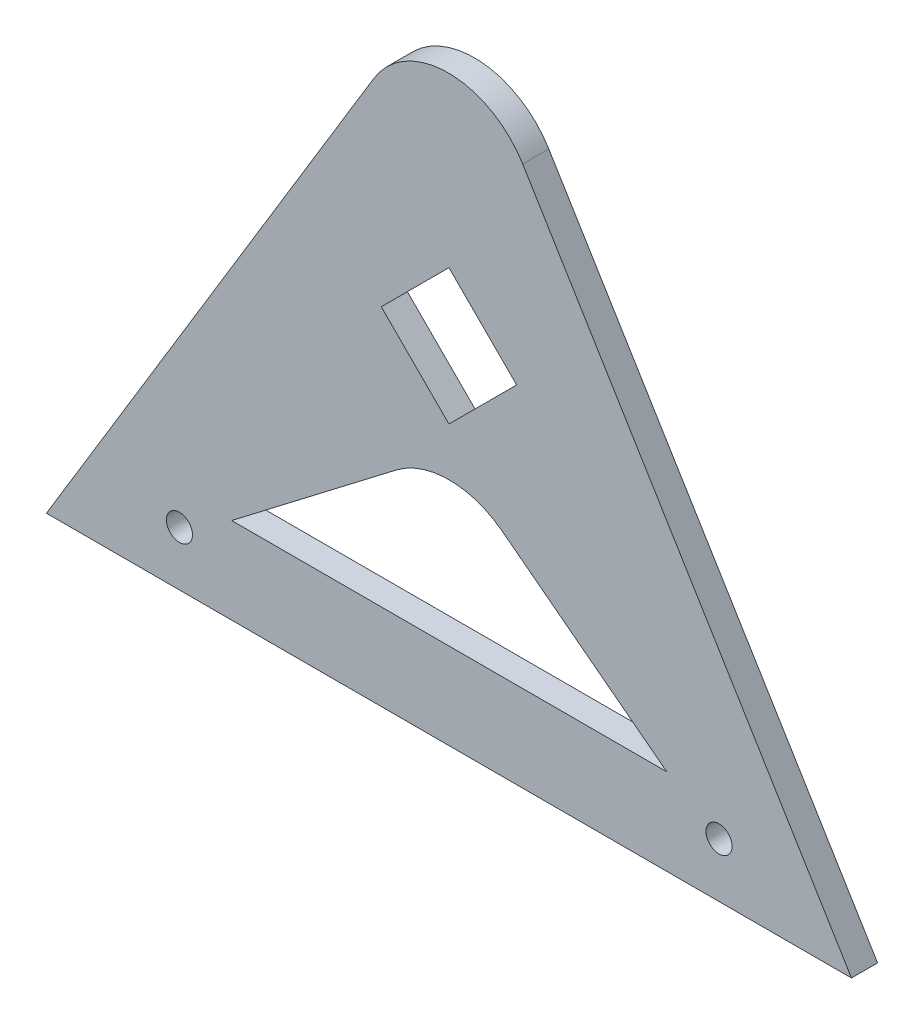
ISO-10303-21;
HEADER;
FILE_DESCRIPTION(('STEP AP214'),'2;1');
FILE_NAME('part.step','',(''),(''),'','','');
FILE_SCHEMA(('AUTOMOTIVE_DESIGN { 1 0 10303 214 1 1 1 1 }'));
ENDSEC;
DATA;
#1=APPLICATION_CONTEXT('core data for automotive mechanical design processes');
#2=APPLICATION_PROTOCOL_DEFINITION('international standard','automotive_design',2000,#1);
#3=PRODUCT_CONTEXT('',#1,'mechanical');
#4=PRODUCT('Part','Part','',(#3));
#5=PRODUCT_RELATED_PRODUCT_CATEGORY('part','',(#4));
#6=PRODUCT_DEFINITION_FORMATION('','',#4);
#7=PRODUCT_DEFINITION_CONTEXT('part definition',#1,'design');
#8=PRODUCT_DEFINITION('design','',#6,#7);
#9=PRODUCT_DEFINITION_SHAPE('','',#8);
#10=(LENGTH_UNIT() NAMED_UNIT(*) SI_UNIT(.MILLI.,.METRE.));
#11=(NAMED_UNIT(*) PLANE_ANGLE_UNIT() SI_UNIT($,.RADIAN.));
#12=(NAMED_UNIT(*) SI_UNIT($,.STERADIAN.) SOLID_ANGLE_UNIT());
#13=UNCERTAINTY_MEASURE_WITH_UNIT(LENGTH_MEASURE(1.E-05),#10,'distance_accuracy_value','');
#14=(GEOMETRIC_REPRESENTATION_CONTEXT(3) GLOBAL_UNCERTAINTY_ASSIGNED_CONTEXT((#13)) GLOBAL_UNIT_ASSIGNED_CONTEXT((#10,
#11,#12)) REPRESENTATION_CONTEXT('',''));
#15=CARTESIAN_POINT('',(0.,0.,0.));
#16=DIRECTION('',(0.,0.,1.));
#17=DIRECTION('',(1.,0.,0.));
#18=AXIS2_PLACEMENT_3D('',#15,#16,#17);
#19=CARTESIAN_POINT('',(-0.204337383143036,59.15629532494,3.));
#20=DIRECTION('',(0.,0.,1.));
#21=DIRECTION('',(1.,0.,0.));
#22=AXIS2_PLACEMENT_3D('',#19,#20,#21);
#23=PLANE('',#22);
#24=CARTESIAN_POINT('',(30.8992011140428,8.48145520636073,3.));
#25=DIRECTION('',(0.,0.,1.));
#26=DIRECTION('',(-1.,0.,0.));
#27=AXIS2_PLACEMENT_3D('',#24,#25,#26);
#28=CIRCLE('',#27,1.5);
#29=CARTESIAN_POINT('',(29.3992011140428,8.48145520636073,3.));
#30=VERTEX_POINT('',#29);
#31=EDGE_CURVE('E153',#30,#30,#28,.T.);
#32=ORIENTED_EDGE('',*,*,#31,.F.);
#33=EDGE_LOOP('',(#32));
#34=FACE_BOUND('',#33,.T.);
#35=DIRECTION('',(-0.793982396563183,0.607940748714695,0.));
#36=VECTOR('',#35,1.);
#37=CARTESIAN_POINT('',(24.8992011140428,12.1603873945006,3.));
#38=LINE('',#37,#36);
#39=CARTESIAN_POINT('',(24.8992011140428,12.1603873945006,3.));
#40=VERTEX_POINT('',#39);
#41=CARTESIAN_POINT('',(5.9786086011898,26.6476093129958,3.));
#42=VERTEX_POINT('',#41);
#43=EDGE_CURVE('E176',#40,#42,#38,.T.);
#44=ORIENTED_EDGE('',*,*,#43,.F.);
#45=DIRECTION('',(1.,0.,0.));
#46=VECTOR('',#45,1.);
#47=CARTESIAN_POINT('',(-25.1007988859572,12.1603873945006,3.));
#48=LINE('',#47,#46);
#49=CARTESIAN_POINT('',(-25.1007988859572,12.1603873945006,3.));
#50=VERTEX_POINT('',#49);
#51=EDGE_CURVE('E174',#50,#40,#48,.T.);
#52=ORIENTED_EDGE('',*,*,#51,.F.);
#53=DIRECTION('',(-0.793982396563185,-0.607940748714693,0.));
#54=VECTOR('',#53,1.);
#55=CARTESIAN_POINT('',(-6.18020637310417,26.6476093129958,3.));
#56=LINE('',#55,#54);
#57=CARTESIAN_POINT('',(-6.18020637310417,26.6476093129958,3.));
#58=VERTEX_POINT('',#57);
#59=EDGE_CURVE('E181',#58,#50,#56,.T.);
#60=ORIENTED_EDGE('',*,*,#59,.F.);
#61=CARTESIAN_POINT('',(-0.100798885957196,18.707785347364,3.));
#62=DIRECTION('',(0.,0.,1.));
#63=DIRECTION('',(1.,0.,0.));
#64=AXIS2_PLACEMENT_3D('',#61,#62,#63);
#65=CIRCLE('',#64,10.);
#66=EDGE_CURVE('E178',#42,#58,#65,.T.);
#67=ORIENTED_EDGE('',*,*,#66,.F.);
#68=EDGE_LOOP('',(#44,#52,#60,#67));
#69=FACE_BOUND('',#68,.T.);
#70=DIRECTION('',(1.,0.,0.));
#71=VECTOR('',#70,1.);
#72=CARTESIAN_POINT('',(-46.3848529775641,2.24624765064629,3.));
#73=LINE('',#72,#71);
#74=CARTESIAN_POINT('',(-46.3848529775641,2.24624765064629,3.));
#75=VERTEX_POINT('',#74);
#76=CARTESIAN_POINT('',(46.1151470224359,2.2462476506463,3.));
#77=VERTEX_POINT('',#76);
#78=EDGE_CURVE('E202',#75,#77,#73,.T.);
#79=ORIENTED_EDGE('',*,*,#78,.T.);
#80=DIRECTION('',(-0.519662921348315,0.854371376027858,0.));
#81=VECTOR('',#80,1.);
#82=CARTESIAN_POINT('',(46.1151470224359,2.2462476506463,3.));
#83=LINE('',#82,#81);
#84=CARTESIAN_POINT('',(8.33937637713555,64.3529245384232,3.));
#85=VERTEX_POINT('',#84);
#86=EDGE_CURVE('E205',#77,#85,#83,.T.);
#87=ORIENTED_EDGE('',*,*,#86,.T.);
#88=CARTESIAN_POINT('',(-0.204337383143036,59.15629532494,3.));
#89=DIRECTION('',(0.,0.,1.));
#90=DIRECTION('',(1.,0.,0.));
#91=AXIS2_PLACEMENT_3D('',#88,#89,#90);
#92=CIRCLE('',#91,10.);
#93=CARTESIAN_POINT('',(-8.75653688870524,64.3389475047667,3.));
#94=VERTEX_POINT('',#93);
#95=EDGE_CURVE('E207',#85,#94,#92,.T.);
#96=ORIENTED_EDGE('',*,*,#95,.T.);
#97=DIRECTION('',(-0.518265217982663,-0.85521995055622,0.));
#98=VECTOR('',#97,1.);
#99=CARTESIAN_POINT('',(-46.3848529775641,2.24624765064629,3.));
#100=LINE('',#99,#98);
#101=EDGE_CURVE('E209',#94,#75,#100,.T.);
#102=ORIENTED_EDGE('',*,*,#101,.T.);
#103=EDGE_LOOP('',(#79,#87,#96,#102));
#104=FACE_BOUND('',#103,.T.);
#105=CARTESIAN_POINT('',(-31.1007988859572,8.48145520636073,3.));
#106=DIRECTION('',(0.,0.,1.));
#107=DIRECTION('',(1.,0.,0.));
#108=AXIS2_PLACEMENT_3D('',#105,#106,#107);
#109=CIRCLE('',#108,1.5);
#110=CARTESIAN_POINT('',(-29.6007988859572,8.48145520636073,3.));
#111=VERTEX_POINT('',#110);
#112=EDGE_CURVE('E159',#111,#111,#109,.T.);
#113=ORIENTED_EDGE('',*,*,#112,.F.);
#114=EDGE_LOOP('',(#113));
#115=FACE_BOUND('',#114,.T.);
#116=DIRECTION('',(0.707106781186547,0.707106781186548,0.));
#117=VECTOR('',#116,1.);
#118=CARTESIAN_POINT('',(7.64332161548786,42.0244222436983,3.));
#119=LINE('',#118,#117);
#120=CARTESIAN_POINT('',(-0.134852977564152,34.2462476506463,3.));
#121=VERTEX_POINT('',#120);
#122=CARTESIAN_POINT('',(7.64332161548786,42.0244222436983,3.));
#123=VERTEX_POINT('',#122);
#124=EDGE_CURVE('E141',#121,#123,#119,.T.);
#125=ORIENTED_EDGE('',*,*,#124,.F.);
#126=DIRECTION('',(0.707106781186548,-0.707106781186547,0.));
#127=VECTOR('',#126,1.);
#128=CARTESIAN_POINT('',(-7.91302757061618,42.0244222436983,3.));
#129=LINE('',#128,#127);
#130=CARTESIAN_POINT('',(-7.91302757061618,42.0244222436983,3.));
#131=VERTEX_POINT('',#130);
#132=EDGE_CURVE('E130',#131,#121,#129,.T.);
#133=ORIENTED_EDGE('',*,*,#132,.F.);
#134=DIRECTION('',(-0.707106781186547,-0.707106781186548,0.));
#135=VECTOR('',#134,1.);
#136=CARTESIAN_POINT('',(-0.134852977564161,49.8025968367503,3.));
#137=LINE('',#136,#135);
#138=CARTESIAN_POINT('',(-0.134852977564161,49.8025968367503,3.));
#139=VERTEX_POINT('',#138);
#140=EDGE_CURVE('E145',#139,#131,#137,.T.);
#141=ORIENTED_EDGE('',*,*,#140,.F.);
#142=DIRECTION('',(-0.707106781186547,0.707106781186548,0.));
#143=VECTOR('',#142,1.);
#144=CARTESIAN_POINT('',(-0.134852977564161,49.8025968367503,3.));
#145=LINE('',#144,#143);
#146=EDGE_CURVE('E143',#123,#139,#145,.T.);
#147=ORIENTED_EDGE('',*,*,#146,.F.);
#148=EDGE_LOOP('',(#125,#133,#141,#147));
#149=FACE_BOUND('',#148,.T.);
#150=ADVANCED_FACE('F26',(#34,#69,#104,#115,#149),#23,.T.);
#151=CARTESIAN_POINT('',(-0.204337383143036,59.15629532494,0.));
#152=DIRECTION('',(0.,0.,1.));
#153=DIRECTION('',(1.,0.,0.));
#154=AXIS2_PLACEMENT_3D('',#151,#152,#153);
#155=PLANE('',#154);
#156=CARTESIAN_POINT('',(30.8992011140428,8.48145520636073,0.));
#157=DIRECTION('',(0.,0.,1.));
#158=DIRECTION('',(-1.,0.,0.));
#159=AXIS2_PLACEMENT_3D('',#156,#157,#158);
#160=CIRCLE('',#159,1.5);
#161=CARTESIAN_POINT('',(29.3992011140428,8.48145520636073,0.));
#162=VERTEX_POINT('',#161);
#163=EDGE_CURVE('E131',#162,#162,#160,.T.);
#164=ORIENTED_EDGE('',*,*,#163,.T.);
#165=EDGE_LOOP('',(#164));
#166=FACE_BOUND('',#165,.T.);
#167=DIRECTION('',(1.,0.,0.));
#168=VECTOR('',#167,1.);
#169=CARTESIAN_POINT('',(-25.1007988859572,12.1603873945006,0.));
#170=LINE('',#169,#168);
#171=CARTESIAN_POINT('',(-25.1007988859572,12.1603873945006,0.));
#172=VERTEX_POINT('',#171);
#173=CARTESIAN_POINT('',(24.8992011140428,12.1603873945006,0.));
#174=VERTEX_POINT('',#173);
#175=EDGE_CURVE('E162',#172,#174,#170,.T.);
#176=ORIENTED_EDGE('',*,*,#175,.T.);
#177=DIRECTION('',(-0.793982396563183,0.607940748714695,0.));
#178=VECTOR('',#177,1.);
#179=CARTESIAN_POINT('',(24.8992011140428,12.1603873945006,0.));
#180=LINE('',#179,#178);
#181=CARTESIAN_POINT('',(5.9786086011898,26.6476093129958,0.));
#182=VERTEX_POINT('',#181);
#183=EDGE_CURVE('E165',#174,#182,#180,.T.);
#184=ORIENTED_EDGE('',*,*,#183,.T.);
#185=CARTESIAN_POINT('',(-0.100798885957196,18.707785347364,0.));
#186=DIRECTION('',(0.,0.,1.));
#187=DIRECTION('',(1.,0.,0.));
#188=AXIS2_PLACEMENT_3D('',#185,#186,#187);
#189=CIRCLE('',#188,10.);
#190=CARTESIAN_POINT('',(-6.18020637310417,26.6476093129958,0.));
#191=VERTEX_POINT('',#190);
#192=EDGE_CURVE('E168',#182,#191,#189,.T.);
#193=ORIENTED_EDGE('',*,*,#192,.T.);
#194=DIRECTION('',(-0.793982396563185,-0.607940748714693,0.));
#195=VECTOR('',#194,1.);
#196=CARTESIAN_POINT('',(-6.18020637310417,26.6476093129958,0.));
#197=LINE('',#196,#195);
#198=EDGE_CURVE('E171',#191,#172,#197,.T.);
#199=ORIENTED_EDGE('',*,*,#198,.T.);
#200=EDGE_LOOP('',(#176,#184,#193,#199));
#201=FACE_BOUND('',#200,.T.);
#202=DIRECTION('',(1.,0.,0.));
#203=VECTOR('',#202,1.);
#204=CARTESIAN_POINT('',(-46.3848529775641,2.24624765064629,0.));
#205=LINE('',#204,#203);
#206=CARTESIAN_POINT('',(-46.3848529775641,2.24624765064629,0.));
#207=VERTEX_POINT('',#206);
#208=CARTESIAN_POINT('',(46.1151470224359,2.2462476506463,0.));
#209=VERTEX_POINT('',#208);
#210=EDGE_CURVE('E193',#207,#209,#205,.T.);
#211=ORIENTED_EDGE('',*,*,#210,.F.);
#212=DIRECTION('',(-0.518265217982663,-0.85521995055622,0.));
#213=VECTOR('',#212,1.);
#214=CARTESIAN_POINT('',(-46.3848529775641,2.24624765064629,0.));
#215=LINE('',#214,#213);
#216=CARTESIAN_POINT('',(-8.75653688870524,64.3389475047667,0.));
#217=VERTEX_POINT('',#216);
#218=EDGE_CURVE('E200',#217,#207,#215,.T.);
#219=ORIENTED_EDGE('',*,*,#218,.F.);
#220=CARTESIAN_POINT('',(-0.204337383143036,59.15629532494,0.));
#221=DIRECTION('',(0.,0.,1.));
#222=DIRECTION('',(1.,0.,0.));
#223=AXIS2_PLACEMENT_3D('',#220,#221,#222);
#224=CIRCLE('',#223,10.);
#225=CARTESIAN_POINT('',(8.33937637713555,64.3529245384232,0.));
#226=VERTEX_POINT('',#225);
#227=EDGE_CURVE('E198',#226,#217,#224,.T.);
#228=ORIENTED_EDGE('',*,*,#227,.F.);
#229=DIRECTION('',(-0.519662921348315,0.854371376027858,0.));
#230=VECTOR('',#229,1.);
#231=CARTESIAN_POINT('',(46.1151470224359,2.2462476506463,0.));
#232=LINE('',#231,#230);
#233=EDGE_CURVE('E196',#209,#226,#232,.T.);
#234=ORIENTED_EDGE('',*,*,#233,.F.);
#235=EDGE_LOOP('',(#211,#219,#228,#234));
#236=FACE_BOUND('',#235,.T.);
#237=CARTESIAN_POINT('',(-31.1007988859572,8.48145520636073,0.));
#238=DIRECTION('',(0.,0.,1.));
#239=DIRECTION('',(1.,0.,0.));
#240=AXIS2_PLACEMENT_3D('',#237,#238,#239);
#241=CIRCLE('',#240,1.5);
#242=CARTESIAN_POINT('',(-29.6007988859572,8.48145520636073,0.));
#243=VERTEX_POINT('',#242);
#244=EDGE_CURVE('E156',#243,#243,#241,.T.);
#245=ORIENTED_EDGE('',*,*,#244,.T.);
#246=EDGE_LOOP('',(#245));
#247=FACE_BOUND('',#246,.T.);
#248=DIRECTION('',(0.707106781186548,-0.707106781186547,0.));
#249=VECTOR('',#248,1.);
#250=CARTESIAN_POINT('',(-7.91302757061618,42.0244222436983,0.));
#251=LINE('',#250,#249);
#252=CARTESIAN_POINT('',(-7.91302757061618,42.0244222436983,0.));
#253=VERTEX_POINT('',#252);
#254=CARTESIAN_POINT('',(-0.134852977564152,34.2462476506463,0.));
#255=VERTEX_POINT('',#254);
#256=EDGE_CURVE('E49',#253,#255,#251,.T.);
#257=ORIENTED_EDGE('',*,*,#256,.T.);
#258=DIRECTION('',(0.707106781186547,0.707106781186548,0.));
#259=VECTOR('',#258,1.);
#260=CARTESIAN_POINT('',(7.64332161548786,42.0244222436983,0.));
#261=LINE('',#260,#259);
#262=CARTESIAN_POINT('',(7.64332161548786,42.0244222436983,0.));
#263=VERTEX_POINT('',#262);
#264=EDGE_CURVE('E117',#255,#263,#261,.T.);
#265=ORIENTED_EDGE('',*,*,#264,.T.);
#266=DIRECTION('',(-0.707106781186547,0.707106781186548,0.));
#267=VECTOR('',#266,1.);
#268=CARTESIAN_POINT('',(-0.134852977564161,49.8025968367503,0.));
#269=LINE('',#268,#267);
#270=CARTESIAN_POINT('',(-0.134852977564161,49.8025968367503,0.));
#271=VERTEX_POINT('',#270);
#272=EDGE_CURVE('E126',#263,#271,#269,.T.);
#273=ORIENTED_EDGE('',*,*,#272,.T.);
#274=DIRECTION('',(-0.707106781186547,-0.707106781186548,0.));
#275=VECTOR('',#274,1.);
#276=CARTESIAN_POINT('',(-0.134852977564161,49.8025968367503,0.));
#277=LINE('',#276,#275);
#278=EDGE_CURVE('E135',#271,#253,#277,.T.);
#279=ORIENTED_EDGE('',*,*,#278,.T.);
#280=EDGE_LOOP('',(#257,#265,#273,#279));
#281=FACE_BOUND('',#280,.T.);
#282=ADVANCED_FACE('F134',(#166,#201,#236,#247,#281),#155,.F.);
#283=CARTESIAN_POINT('',(-46.3848529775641,2.24624765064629,3.));
#284=DIRECTION('',(0.,1.,0.));
#285=DIRECTION('',(-1.,0.,0.));
#286=AXIS2_PLACEMENT_3D('',#283,#284,#285);
#287=PLANE('',#286);
#288=ORIENTED_EDGE('',*,*,#210,.T.);
#289=DIRECTION('',(0.,0.,-1.));
#290=VECTOR('',#289,1.);
#291=CARTESIAN_POINT('',(46.1151470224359,2.2462476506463,3.));
#292=LINE('',#291,#290);
#293=EDGE_CURVE('E11',#77,#209,#292,.T.);
#294=ORIENTED_EDGE('',*,*,#293,.F.);
#295=ORIENTED_EDGE('',*,*,#78,.F.);
#296=DIRECTION('',(0.,0.,-1.));
#297=VECTOR('',#296,1.);
#298=CARTESIAN_POINT('',(-46.3848529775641,2.24624765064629,3.));
#299=LINE('',#298,#297);
#300=EDGE_CURVE('E211',#75,#207,#299,.T.);
#301=ORIENTED_EDGE('',*,*,#300,.T.);
#302=EDGE_LOOP('',(#288,#294,#295,#301));
#303=FACE_BOUND('',#302,.T.);
#304=ADVANCED_FACE('F28',(#303),#287,.F.);
#305=CARTESIAN_POINT('',(46.1151470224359,2.2462476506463,3.));
#306=DIRECTION('',(-0.854371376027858,-0.519662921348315,0.));
#307=DIRECTION('',(0.519662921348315,-0.854371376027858,0.));
#308=AXIS2_PLACEMENT_3D('',#305,#306,#307);
#309=PLANE('',#308);
#310=ORIENTED_EDGE('',*,*,#233,.T.);
#311=DIRECTION('',(0.,0.,-1.));
#312=VECTOR('',#311,1.);
#313=CARTESIAN_POINT('',(8.33937637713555,64.3529245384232,3.));
#314=LINE('',#313,#312);
#315=EDGE_CURVE('E34',#85,#226,#314,.T.);
#316=ORIENTED_EDGE('',*,*,#315,.F.);
#317=ORIENTED_EDGE('',*,*,#86,.F.);
#318=ORIENTED_EDGE('',*,*,#293,.T.);
#319=EDGE_LOOP('',(#310,#316,#317,#318));
#320=FACE_BOUND('',#319,.T.);
#321=ADVANCED_FACE('F237',(#320),#309,.F.);
#322=CARTESIAN_POINT('',(-0.204337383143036,59.15629532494,3.));
#323=DIRECTION('',(0.,0.,-1.));
#324=DIRECTION('',(-1.,0.,0.));
#325=AXIS2_PLACEMENT_3D('',#322,#323,#324);
#326=CYLINDRICAL_SURFACE('',#325,10.);
#327=ORIENTED_EDGE('',*,*,#227,.T.);
#328=DIRECTION('',(0.,0.,-1.));
#329=VECTOR('',#328,1.);
#330=CARTESIAN_POINT('',(-8.75653688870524,64.3389475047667,3.));
#331=LINE('',#330,#329);
#332=EDGE_CURVE('E214',#94,#217,#331,.T.);
#333=ORIENTED_EDGE('',*,*,#332,.F.);
#334=ORIENTED_EDGE('',*,*,#95,.F.);
#335=ORIENTED_EDGE('',*,*,#315,.T.);
#336=EDGE_LOOP('',(#327,#333,#334,#335));
#337=FACE_BOUND('',#336,.T.);
#338=ADVANCED_FACE('F221',(#337),#326,.T.);
#339=CARTESIAN_POINT('',(-46.3848529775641,2.24624765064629,3.));
#340=DIRECTION('',(0.85521995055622,-0.518265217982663,0.));
#341=DIRECTION('',(0.518265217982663,0.85521995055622,0.));
#342=AXIS2_PLACEMENT_3D('',#339,#340,#341);
#343=PLANE('',#342);
#344=ORIENTED_EDGE('',*,*,#218,.T.);
#345=ORIENTED_EDGE('',*,*,#300,.F.);
#346=ORIENTED_EDGE('',*,*,#101,.F.);
#347=ORIENTED_EDGE('',*,*,#332,.T.);
#348=EDGE_LOOP('',(#344,#345,#346,#347));
#349=FACE_BOUND('',#348,.T.);
#350=ADVANCED_FACE('F230',(#349),#343,.F.);
#351=CARTESIAN_POINT('',(-25.1007988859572,12.1603873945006,3.));
#352=DIRECTION('',(0.,1.,0.));
#353=DIRECTION('',(-1.,0.,0.));
#354=AXIS2_PLACEMENT_3D('',#351,#352,#353);
#355=PLANE('',#354);
#356=ORIENTED_EDGE('',*,*,#175,.F.);
#357=DIRECTION('',(0.,0.,-1.));
#358=VECTOR('',#357,1.);
#359=CARTESIAN_POINT('',(-25.1007988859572,12.1603873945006,3.));
#360=LINE('',#359,#358);
#361=EDGE_CURVE('E183',#50,#172,#360,.T.);
#362=ORIENTED_EDGE('',*,*,#361,.F.);
#363=ORIENTED_EDGE('',*,*,#51,.T.);
#364=DIRECTION('',(0.,0.,-1.));
#365=VECTOR('',#364,1.);
#366=CARTESIAN_POINT('',(24.8992011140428,12.1603873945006,3.));
#367=LINE('',#366,#365);
#368=EDGE_CURVE('E190',#40,#174,#367,.T.);
#369=ORIENTED_EDGE('',*,*,#368,.T.);
#370=EDGE_LOOP('',(#356,#362,#363,#369));
#371=FACE_BOUND('',#370,.T.);
#372=ADVANCED_FACE('F257',(#371),#355,.T.);
#373=CARTESIAN_POINT('',(24.8992011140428,12.1603873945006,3.));
#374=DIRECTION('',(-0.607940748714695,-0.793982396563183,0.));
#375=DIRECTION('',(0.793982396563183,-0.607940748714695,0.));
#376=AXIS2_PLACEMENT_3D('',#373,#374,#375);
#377=PLANE('',#376);
#378=ORIENTED_EDGE('',*,*,#183,.F.);
#379=ORIENTED_EDGE('',*,*,#368,.F.);
#380=ORIENTED_EDGE('',*,*,#43,.T.);
#381=DIRECTION('',(0.,0.,-1.));
#382=VECTOR('',#381,1.);
#383=CARTESIAN_POINT('',(5.9786086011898,26.6476093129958,3.));
#384=LINE('',#383,#382);
#385=EDGE_CURVE('E188',#42,#182,#384,.T.);
#386=ORIENTED_EDGE('',*,*,#385,.T.);
#387=EDGE_LOOP('',(#378,#379,#380,#386));
#388=FACE_BOUND('',#387,.T.);
#389=ADVANCED_FACE('F261',(#388),#377,.T.);
#390=CARTESIAN_POINT('',(-0.100798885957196,18.707785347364,3.));
#391=DIRECTION('',(0.,0.,-1.));
#392=DIRECTION('',(-1.,0.,0.));
#393=AXIS2_PLACEMENT_3D('',#390,#391,#392);
#394=CYLINDRICAL_SURFACE('',#393,10.);
#395=ORIENTED_EDGE('',*,*,#192,.F.);
#396=ORIENTED_EDGE('',*,*,#385,.F.);
#397=ORIENTED_EDGE('',*,*,#66,.T.);
#398=DIRECTION('',(0.,0.,-1.));
#399=VECTOR('',#398,1.);
#400=CARTESIAN_POINT('',(-6.18020637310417,26.6476093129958,3.));
#401=LINE('',#400,#399);
#402=EDGE_CURVE('E186',#58,#191,#401,.T.);
#403=ORIENTED_EDGE('',*,*,#402,.T.);
#404=EDGE_LOOP('',(#395,#396,#397,#403));
#405=FACE_BOUND('',#404,.T.);
#406=ADVANCED_FACE('F266',(#405),#394,.F.);
#407=CARTESIAN_POINT('',(-6.18020637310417,26.6476093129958,3.));
#408=DIRECTION('',(0.607940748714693,-0.793982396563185,0.));
#409=DIRECTION('',(0.793982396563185,0.607940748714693,0.));
#410=AXIS2_PLACEMENT_3D('',#407,#408,#409);
#411=PLANE('',#410);
#412=ORIENTED_EDGE('',*,*,#198,.F.);
#413=ORIENTED_EDGE('',*,*,#402,.F.);
#414=ORIENTED_EDGE('',*,*,#59,.T.);
#415=ORIENTED_EDGE('',*,*,#361,.T.);
#416=EDGE_LOOP('',(#412,#413,#414,#415));
#417=FACE_BOUND('',#416,.T.);
#418=ADVANCED_FACE('F272',(#417),#411,.T.);
#419=CARTESIAN_POINT('',(-31.1007988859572,8.48145520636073,3.));
#420=DIRECTION('',(0.,0.,-1.));
#421=DIRECTION('',(-1.,0.,0.));
#422=AXIS2_PLACEMENT_3D('',#419,#420,#421);
#423=CYLINDRICAL_SURFACE('',#422,1.5);
#424=ORIENTED_EDGE('',*,*,#112,.T.);
#425=EDGE_LOOP('',(#424));
#426=FACE_BOUND('',#425,.T.);
#427=ORIENTED_EDGE('',*,*,#244,.F.);
#428=EDGE_LOOP('',(#427));
#429=FACE_BOUND('',#428,.T.);
#430=ADVANCED_FACE('F276',(#426,#429),#423,.F.);
#431=CARTESIAN_POINT('',(30.8992011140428,8.48145520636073,3.));
#432=DIRECTION('',(0.,0.,-1.));
#433=DIRECTION('',(-1.,0.,0.));
#434=AXIS2_PLACEMENT_3D('',#431,#432,#433);
#435=CYLINDRICAL_SURFACE('',#434,1.5);
#436=ORIENTED_EDGE('',*,*,#31,.T.);
#437=EDGE_LOOP('',(#436));
#438=FACE_BOUND('',#437,.T.);
#439=ORIENTED_EDGE('',*,*,#163,.F.);
#440=EDGE_LOOP('',(#439));
#441=FACE_BOUND('',#440,.T.);
#442=ADVANCED_FACE('F280',(#438,#441),#435,.F.);
#443=CARTESIAN_POINT('',(-7.91302757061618,42.0244222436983,3.));
#444=DIRECTION('',(0.707106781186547,0.707106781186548,0.));
#445=DIRECTION('',(-0.707106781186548,0.707106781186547,0.));
#446=AXIS2_PLACEMENT_3D('',#443,#444,#445);
#447=PLANE('',#446);
#448=ORIENTED_EDGE('',*,*,#256,.F.);
#449=DIRECTION('',(0.,0.,-1.));
#450=VECTOR('',#449,1.);
#451=CARTESIAN_POINT('',(-7.91302757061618,42.0244222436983,3.));
#452=LINE('',#451,#450);
#453=EDGE_CURVE('E147',#131,#253,#452,.T.);
#454=ORIENTED_EDGE('',*,*,#453,.F.);
#455=ORIENTED_EDGE('',*,*,#132,.T.);
#456=DIRECTION('',(0.,0.,-1.));
#457=VECTOR('',#456,1.);
#458=CARTESIAN_POINT('',(-0.134852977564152,34.2462476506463,3.));
#459=LINE('',#458,#457);
#460=EDGE_CURVE('E119',#121,#255,#459,.T.);
#461=ORIENTED_EDGE('',*,*,#460,.T.);
#462=EDGE_LOOP('',(#448,#454,#455,#461));
#463=FACE_BOUND('',#462,.T.);
#464=ADVANCED_FACE('F128',(#463),#447,.T.);
#465=CARTESIAN_POINT('',(7.64332161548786,42.0244222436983,3.));
#466=DIRECTION('',(-0.707106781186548,0.707106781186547,0.));
#467=DIRECTION('',(-0.707106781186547,-0.707106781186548,0.));
#468=AXIS2_PLACEMENT_3D('',#465,#466,#467);
#469=PLANE('',#468);
#470=ORIENTED_EDGE('',*,*,#264,.F.);
#471=ORIENTED_EDGE('',*,*,#460,.F.);
#472=ORIENTED_EDGE('',*,*,#124,.T.);
#473=DIRECTION('',(0.,0.,-1.));
#474=VECTOR('',#473,1.);
#475=CARTESIAN_POINT('',(7.64332161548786,42.0244222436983,3.));
#476=LINE('',#475,#474);
#477=EDGE_CURVE('E122',#123,#263,#476,.T.);
#478=ORIENTED_EDGE('',*,*,#477,.T.);
#479=EDGE_LOOP('',(#470,#471,#472,#478));
#480=FACE_BOUND('',#479,.T.);
#481=ADVANCED_FACE('F118',(#480),#469,.T.);
#482=CARTESIAN_POINT('',(-0.134852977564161,49.8025968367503,3.));
#483=DIRECTION('',(-0.707106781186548,-0.707106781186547,0.));
#484=DIRECTION('',(0.707106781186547,-0.707106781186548,0.));
#485=AXIS2_PLACEMENT_3D('',#482,#483,#484);
#486=PLANE('',#485);
#487=ORIENTED_EDGE('',*,*,#272,.F.);
#488=ORIENTED_EDGE('',*,*,#477,.F.);
#489=ORIENTED_EDGE('',*,*,#146,.T.);
#490=DIRECTION('',(0.,0.,-1.));
#491=VECTOR('',#490,1.);
#492=CARTESIAN_POINT('',(-0.134852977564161,49.8025968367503,3.));
#493=LINE('',#492,#491);
#494=EDGE_CURVE('E41',#139,#271,#493,.T.);
#495=ORIENTED_EDGE('',*,*,#494,.T.);
#496=EDGE_LOOP('',(#487,#488,#489,#495));
#497=FACE_BOUND('',#496,.T.);
#498=ADVANCED_FACE('F289',(#497),#486,.T.);
#499=CARTESIAN_POINT('',(-0.134852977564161,49.8025968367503,3.));
#500=DIRECTION('',(0.707106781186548,-0.707106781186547,0.));
#501=DIRECTION('',(0.707106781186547,0.707106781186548,0.));
#502=AXIS2_PLACEMENT_3D('',#499,#500,#501);
#503=PLANE('',#502);
#504=ORIENTED_EDGE('',*,*,#278,.F.);
#505=ORIENTED_EDGE('',*,*,#494,.F.);
#506=ORIENTED_EDGE('',*,*,#140,.T.);
#507=ORIENTED_EDGE('',*,*,#453,.T.);
#508=EDGE_LOOP('',(#504,#505,#506,#507));
#509=FACE_BOUND('',#508,.T.);
#510=ADVANCED_FACE('F292',(#509),#503,.T.);
#511=CLOSED_SHELL('',(#150,#282,#304,#321,#338,#350,#372,#389,#406,#418,#430,#442,#464,#481,
#498,#510));
#512=MANIFOLD_SOLID_BREP('B2',#511);
#513=ADVANCED_BREP_SHAPE_REPRESENTATION('',(#18,#512),#14);
#514=SHAPE_DEFINITION_REPRESENTATION(#9,#513);
ENDSEC;
END-ISO-10303-21;
